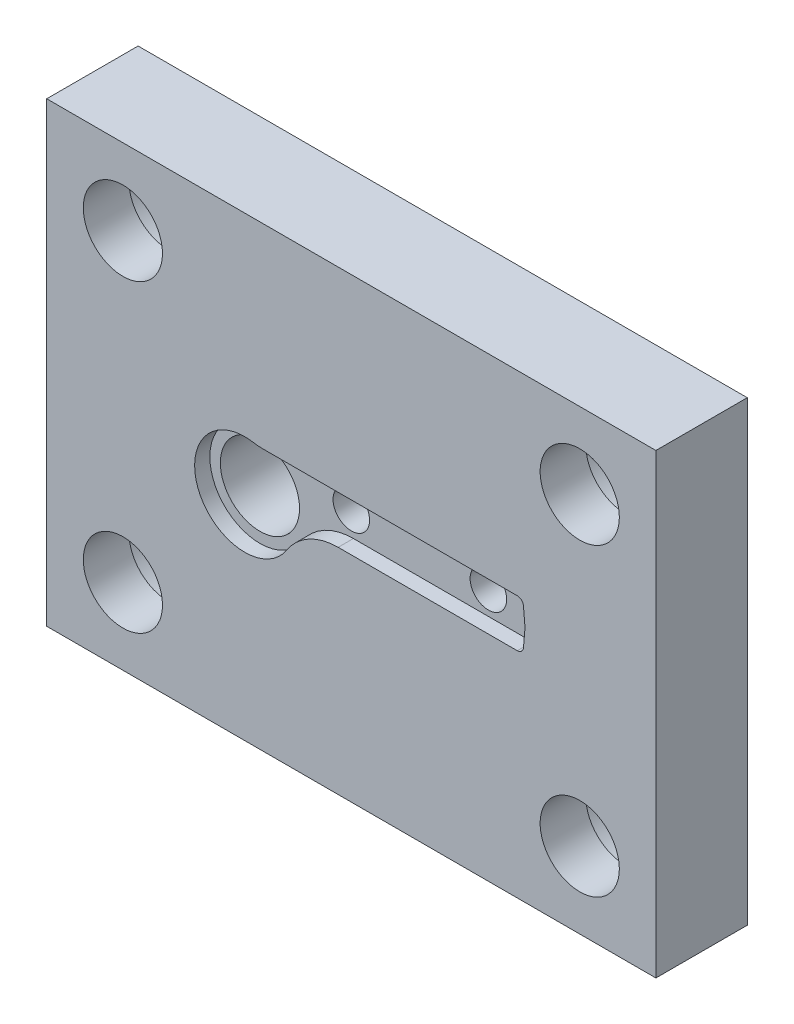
from build123d import *

# Parameters (mm, degrees)
ESQUISSE1_W             = 200
ESQUISSE1_H             = 150
BASE_EXTRUSION_DEPTH    = 30
ENL_V_MAT_EXTRU_1_DEPTH = 5
ESQUISSE3_R             = 13
ENL_V_MAT_EXTRU_2_DEPTH = 252.246890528
ESQUISSE6_R             = 6
ENL_V_MAT_EXTRU_5_DEPTH = 13
ESQUISSE7_R             = 9
ENL_V_MAT_EXTRU_6_DEPTH = 251.647162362
ESQUISSE8_R             = 13
ENL_V_MAT_EXTRU_7_DEPTH = 15
ESQUISSE9_R             = 20
ENL_V_MAT_EXTRU_8_DEPTH = 251.449595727


with BuildPart() as part:
    # Esquisse1 → Base-Extrusion (new body)
    with BuildSketch(Plane.XY):
        with Locations((100, 75)):
            Rectangle(ESQUISSE1_W, ESQUISSE1_H)
    extrude(amount=BASE_EXTRUSION_DEPTH)

    # Esquisse2 → Enl_v. mat.-Extru.1 (cut)
    with BuildSketch(Plane.XY.offset(30)):
        with BuildLine():
            Line((71.07819052, 85.935), (154.489847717, 85.935))
            ThreePointArc((154.489847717, 85.935), (155.861295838, 85.401672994), (156.512122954, 84.081926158))
            Line((156.512122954, 84.081926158), (157.033723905, 78.12))
            Line((157.033723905, 78.12), (156.512122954, 72.158073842))
            ThreePointArc((156.512122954, 72.158073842), (155.861295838, 70.838327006), (154.489847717, 70.305))
            Line((154.489847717, 70.305), (95.681427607, 70.305))
            ThreePointArc((95.681427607, 70.305), (86.083538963, 67.855711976), (78.832928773, 61.106850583))
            ThreePointArc((78.832928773, 61.106850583), (49.957582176, 63.354423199), (67.740393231, 86.215063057))
            ThreePointArc((67.740393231, 86.215063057), (69.403427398, 86.005138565), (71.07819052, 85.935))
        make_face()
    extrude(amount=-ENL_V_MAT_EXTRU_1_DEPTH, mode=Mode.SUBTRACT)

    # Esquisse3 → Enl_v. mat.-Extru.2 (cut, through all)
    with BuildSketch(Plane.XY.offset(25)):
        with Locations((65, 70)):
            Circle(ESQUISSE3_R)
    extrude(amount=-ENL_V_MAT_EXTRU_2_DEPTH, mode=Mode.SUBTRACT)

    # Esquisse6 → Enl_v. mat.-Extru.5 (cut)
    with BuildSketch(Plane.XY.offset(25)):
        with Locations((140, 78.12)):
            Circle(ESQUISSE6_R)
        with Locations((95, 78.12)):
            Circle(ESQUISSE6_R)
    extrude(amount=-ENL_V_MAT_EXTRU_5_DEPTH, mode=Mode.SUBTRACT)

    # Esquisse7 → Enl_v. mat.-Extru.6 (cut, through all)
    with BuildSketch(Plane.XY.offset(12)):
        with Locations((140, 78.12)):
            Circle(ESQUISSE7_R)
        with Locations((95, 78.12)):
            Circle(ESQUISSE7_R)
    extrude(amount=-ENL_V_MAT_EXTRU_6_DEPTH, mode=Mode.SUBTRACT)

    # Esquisse8 → Enl_v. mat.-Extru.7 (cut)
    with BuildSketch(Plane.XY.offset(30)):
        with Locations((25, 125)):
            Circle(ESQUISSE8_R)
        with Locations((25, 25)):
            Circle(ESQUISSE8_R)
        with Locations((175, 25)):
            Circle(ESQUISSE8_R)
        with Locations((175, 125)):
            Circle(ESQUISSE8_R)
    extrude(amount=-ENL_V_MAT_EXTRU_7_DEPTH, mode=Mode.SUBTRACT)

    # Esquisse9 → Enl_v. mat.-Extru.8 (cut, through all)
    with BuildSketch(Plane.XY.offset(15)):
        with Locations((25, 125)):
            Circle(ESQUISSE9_R)
        with Locations((175, 125)):
            Circle(ESQUISSE9_R)
        with Locations((175, 25)):
            Circle(ESQUISSE9_R)
        with Locations((25, 25)):
            Circle(ESQUISSE9_R)
    extrude(amount=-ENL_V_MAT_EXTRU_8_DEPTH, mode=Mode.SUBTRACT)


solid = part.part
